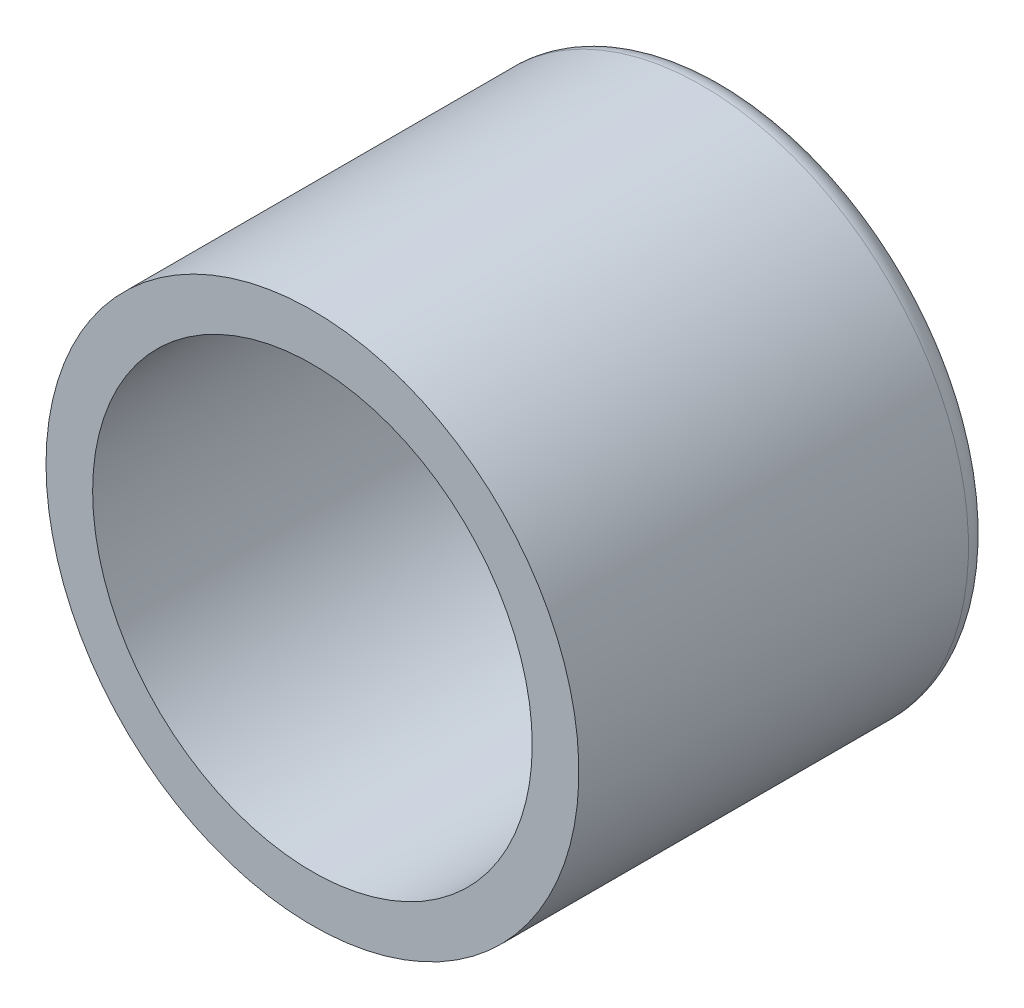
ISO-10303-21;
HEADER;
FILE_DESCRIPTION(('STEP AP214'),'2;1');
FILE_NAME('part.step','',(''),(''),'','','');
FILE_SCHEMA(('AUTOMOTIVE_DESIGN { 1 0 10303 214 1 1 1 1 }'));
ENDSEC;
DATA;
#1=APPLICATION_CONTEXT('core data for automotive mechanical design processes');
#2=APPLICATION_PROTOCOL_DEFINITION('international standard','automotive_design',2000,#1);
#3=PRODUCT_CONTEXT('',#1,'mechanical');
#4=PRODUCT('Part','Part','',(#3));
#5=PRODUCT_RELATED_PRODUCT_CATEGORY('part','',(#4));
#6=PRODUCT_DEFINITION_FORMATION('','',#4);
#7=PRODUCT_DEFINITION_CONTEXT('part definition',#1,'design');
#8=PRODUCT_DEFINITION('design','',#6,#7);
#9=PRODUCT_DEFINITION_SHAPE('','',#8);
#10=(LENGTH_UNIT() NAMED_UNIT(*) SI_UNIT(.MILLI.,.METRE.));
#11=(NAMED_UNIT(*) PLANE_ANGLE_UNIT() SI_UNIT($,.RADIAN.));
#12=(NAMED_UNIT(*) SI_UNIT($,.STERADIAN.) SOLID_ANGLE_UNIT());
#13=UNCERTAINTY_MEASURE_WITH_UNIT(LENGTH_MEASURE(1.E-05),#10,'distance_accuracy_value','');
#14=(GEOMETRIC_REPRESENTATION_CONTEXT(3) GLOBAL_UNCERTAINTY_ASSIGNED_CONTEXT((#13)) GLOBAL_UNIT_ASSIGNED_CONTEXT((#10,
#11,#12)) REPRESENTATION_CONTEXT('',''));
#15=CARTESIAN_POINT('',(0.,0.,0.));
#16=DIRECTION('',(0.,0.,1.));
#17=DIRECTION('',(1.,0.,0.));
#18=AXIS2_PLACEMENT_3D('',#15,#16,#17);
#19=CARTESIAN_POINT('',(0.,0.,12.4));
#20=DIRECTION('',(0.,0.,-1.));
#21=DIRECTION('',(-1.,0.,0.));
#22=AXIS2_PLACEMENT_3D('',#19,#20,#21);
#23=CYLINDRICAL_SURFACE('',#22,6.6);
#24=CARTESIAN_POINT('',(0.,0.,0.200000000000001));
#25=DIRECTION('',(0.,0.,-1.));
#26=DIRECTION('',(-1.,0.,0.));
#27=AXIS2_PLACEMENT_3D('',#24,#25,#26);
#28=CIRCLE('',#27,6.6);
#29=CARTESIAN_POINT('',(-6.6,0.,0.200000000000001));
#30=VERTEX_POINT('',#29);
#31=EDGE_CURVE('E10',#30,#30,#28,.T.);
#32=ORIENTED_EDGE('',*,*,#31,.T.);
#33=EDGE_LOOP('',(#32));
#34=FACE_BOUND('',#33,.T.);
#35=CARTESIAN_POINT('',(0.,0.,12.4));
#36=DIRECTION('',(0.,0.,-1.));
#37=DIRECTION('',(-1.,0.,0.));
#38=AXIS2_PLACEMENT_3D('',#35,#36,#37);
#39=CIRCLE('',#38,6.6);
#40=CARTESIAN_POINT('',(-6.6,0.,12.4));
#41=VERTEX_POINT('',#40);
#42=EDGE_CURVE('E51',#41,#41,#39,.T.);
#43=ORIENTED_EDGE('',*,*,#42,.F.);
#44=EDGE_LOOP('',(#43));
#45=FACE_BOUND('',#44,.T.);
#46=ADVANCED_FACE('F32',(#34,#45),#23,.F.);
#47=CARTESIAN_POINT('',(6.6,0.,0.2));
#48=DIRECTION('',(0.,0.,1.));
#49=DIRECTION('',(1.,0.,0.));
#50=AXIS2_PLACEMENT_3D('',#47,#48,#49);
#51=PLANE('',#50);
#52=ORIENTED_EDGE('',*,*,#31,.F.);
#53=EDGE_LOOP('',(#52));
#54=FACE_BOUND('',#53,.T.);
#55=ADVANCED_FACE('F59',(#54),#51,.T.);
#56=CARTESIAN_POINT('',(0.,0.,0.));
#57=DIRECTION('',(0.,0.,-1.));
#58=DIRECTION('',(-1.,0.,0.));
#59=AXIS2_PLACEMENT_3D('',#56,#57,#58);
#60=PLANE('',#59);
#61=CARTESIAN_POINT('',(0.,0.,0.));
#62=DIRECTION('',(0.,0.,-1.));
#63=DIRECTION('',(-1.,0.,0.));
#64=AXIS2_PLACEMENT_3D('',#61,#62,#63);
#65=CIRCLE('',#64,7.3);
#66=CARTESIAN_POINT('',(-7.3,0.,0.));
#67=VERTEX_POINT('',#66);
#68=EDGE_CURVE('E38',#67,#67,#65,.T.);
#69=ORIENTED_EDGE('',*,*,#68,.T.);
#70=EDGE_LOOP('',(#69));
#71=FACE_BOUND('',#70,.T.);
#72=ADVANCED_FACE('F63',(#71),#60,.T.);
#73=CARTESIAN_POINT('',(0.,0.,0.699999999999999));
#74=DIRECTION('',(0.,0.,-1.));
#75=DIRECTION('',(-1.,0.,0.));
#76=AXIS2_PLACEMENT_3D('',#73,#74,#75);
#77=TOROIDAL_SURFACE('',#76,7.3,0.7);
#78=CARTESIAN_POINT('',(0.,0.,0.699999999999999));
#79=DIRECTION('',(0.,0.,-1.));
#80=DIRECTION('',(-1.,0.,0.));
#81=AXIS2_PLACEMENT_3D('',#78,#79,#80);
#82=CIRCLE('',#81,8.);
#83=CARTESIAN_POINT('',(-8.,0.,0.699999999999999));
#84=VERTEX_POINT('',#83);
#85=EDGE_CURVE('E42',#84,#84,#82,.T.);
#86=ORIENTED_EDGE('',*,*,#85,.T.);
#87=EDGE_LOOP('',(#86));
#88=FACE_BOUND('',#87,.T.);
#89=ORIENTED_EDGE('',*,*,#68,.F.);
#90=EDGE_LOOP('',(#89));
#91=FACE_BOUND('',#90,.T.);
#92=ADVANCED_FACE('F68',(#88,#91),#77,.T.);
#93=CARTESIAN_POINT('',(0.,0.,12.4));
#94=DIRECTION('',(0.,0.,-1.));
#95=DIRECTION('',(-1.,0.,0.));
#96=AXIS2_PLACEMENT_3D('',#93,#94,#95);
#97=CYLINDRICAL_SURFACE('',#96,8.);
#98=CARTESIAN_POINT('',(0.,0.,12.4));
#99=DIRECTION('',(0.,0.,-1.));
#100=DIRECTION('',(-1.,0.,0.));
#101=AXIS2_PLACEMENT_3D('',#98,#99,#100);
#102=CIRCLE('',#101,8.);
#103=CARTESIAN_POINT('',(-8.,0.,12.4));
#104=VERTEX_POINT('',#103);
#105=EDGE_CURVE('E46',#104,#104,#102,.T.);
#106=ORIENTED_EDGE('',*,*,#105,.T.);
#107=EDGE_LOOP('',(#106));
#108=FACE_BOUND('',#107,.T.);
#109=ORIENTED_EDGE('',*,*,#85,.F.);
#110=EDGE_LOOP('',(#109));
#111=FACE_BOUND('',#110,.T.);
#112=ADVANCED_FACE('F73',(#108,#111),#97,.T.);
#113=CARTESIAN_POINT('',(8.,0.,12.4));
#114=DIRECTION('',(0.,0.,1.));
#115=DIRECTION('',(1.,0.,0.));
#116=AXIS2_PLACEMENT_3D('',#113,#114,#115);
#117=PLANE('',#116);
#118=ORIENTED_EDGE('',*,*,#42,.T.);
#119=EDGE_LOOP('',(#118));
#120=FACE_BOUND('',#119,.T.);
#121=ORIENTED_EDGE('',*,*,#105,.F.);
#122=EDGE_LOOP('',(#121));
#123=FACE_BOUND('',#122,.T.);
#124=ADVANCED_FACE('F55',(#120,#123),#117,.T.);
#125=CLOSED_SHELL('',(#46,#55,#72,#92,#112,#124));
#126=MANIFOLD_SOLID_BREP('B2',#125);
#127=ADVANCED_BREP_SHAPE_REPRESENTATION('',(#18,#126),#14);
#128=SHAPE_DEFINITION_REPRESENTATION(#9,#127);
ENDSEC;
END-ISO-10303-21;
